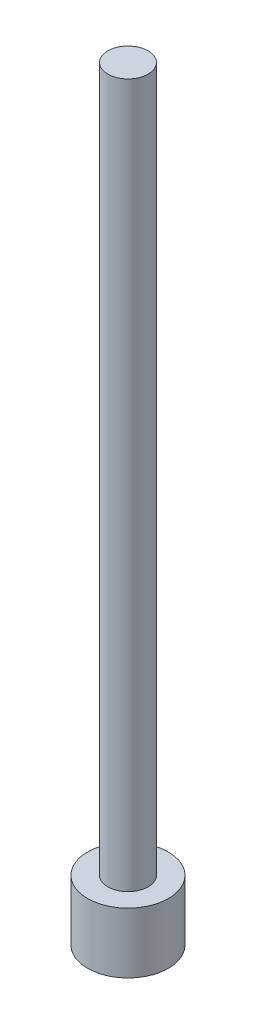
from build123d import *

# Parameters (mm, degrees)
ESQUISSE1_R      = 2
EXTRUSION1_DEPTH = 3
ESQUISSE2_R      = 1
EXTRUSION2_DEPTH = 34.9


with BuildPart() as part:
    # Esquisse1 → Extrusion1 (new body)
    with BuildSketch(Plane(origin=(0, 0, 0), x_dir=(1, 0, 0), z_dir=(0, 1, 0))):
        with Locations(Location((0, 0, 0), (0, 0, 270))):
            Circle(ESQUISSE1_R)
    extrude(amount=EXTRUSION1_DEPTH)

    # Esquisse2 → Extrusion2 (add)
    with BuildSketch(Plane(origin=(0, 3, 0), x_dir=(-1, 0, 0), z_dir=(0, 1, 0))):
        with Locations(Location((0, 0, 0), (0, 0, 90))):
            Circle(ESQUISSE2_R)
    extrude(amount=EXTRUSION2_DEPTH)


solid = part.part
